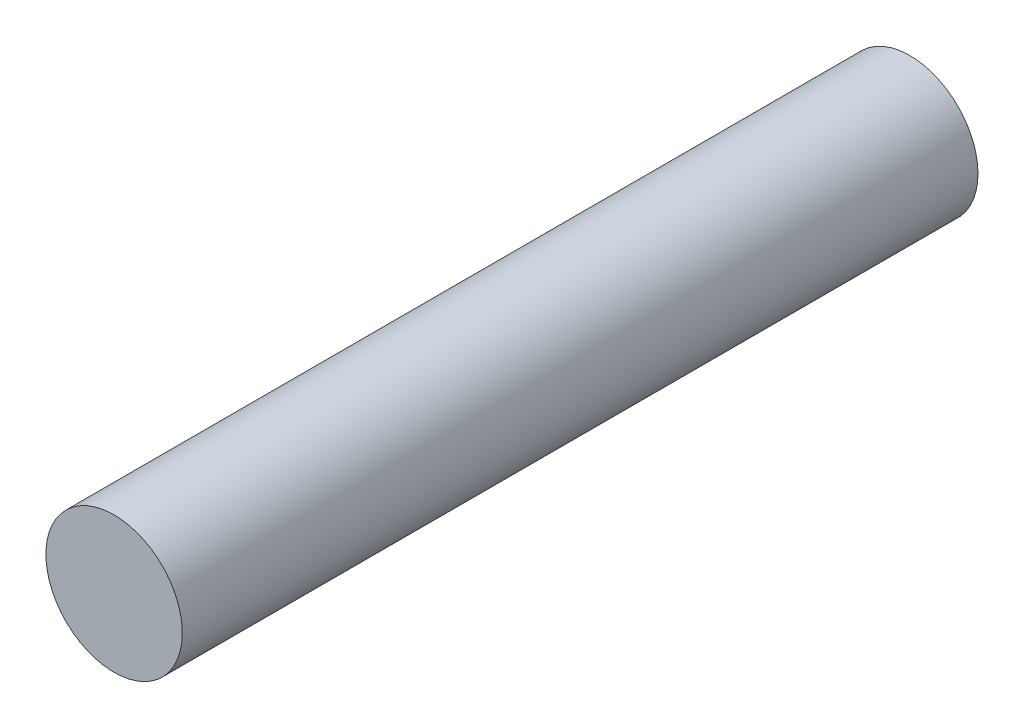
from build123d import *

# Parameters (mm, degrees)
SKETCH1_R           = 30
BOSS_EXTRUDE1_DEPTH = 350


with BuildPart() as part:
    # Sketch1 → Boss-Extrude1 (new body)
    with BuildSketch(Plane.XY):
        Circle(SKETCH1_R)
    extrude(amount=-BOSS_EXTRUDE1_DEPTH)


solid = part.part
